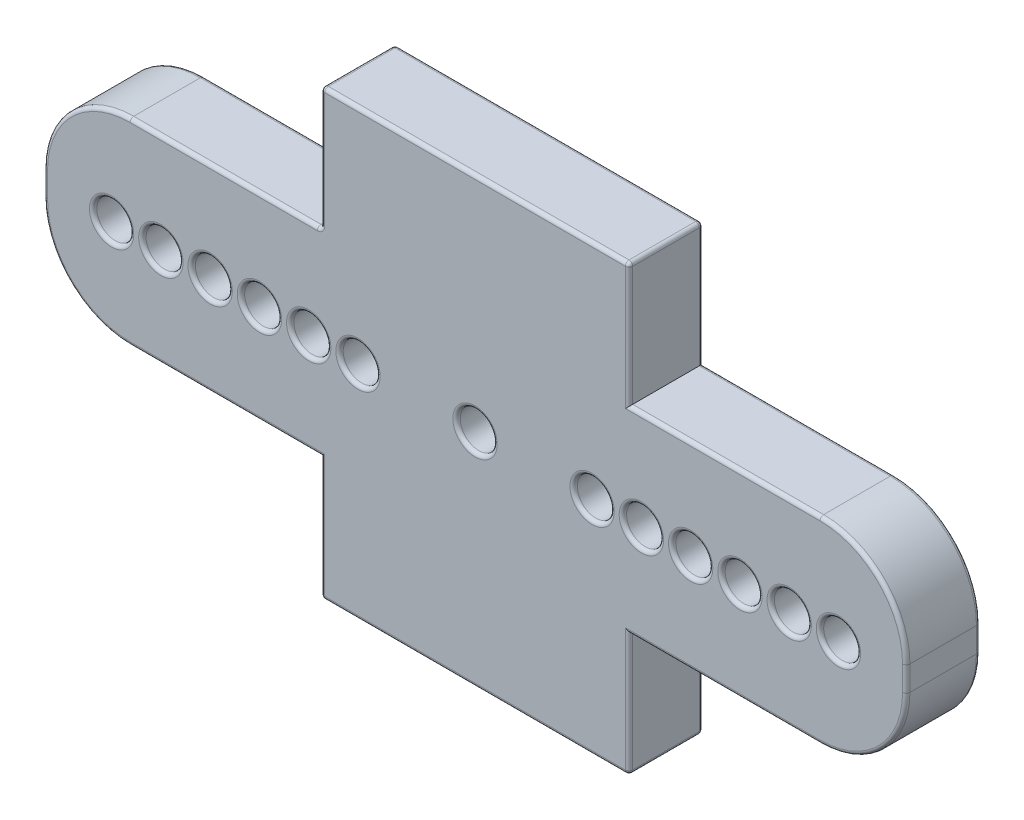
from build123d import *

# Parameters (mm, degrees)
SKETCH1_R           = 0.75
BOSS_EXTRUDE2_DEPTH = 1.5
CUT_EXTRUDE1_REACH  = 21.906
SKETCH2_R           = 0.75
FILLET2_R           = 0.15


with BuildPart() as part:
    # Sketch1 → Boss-Extrude2 (new, symmetric)
    with BuildSketch(Plane.XY):
        with BuildLine():
            Line((-17.5, 0.5), (-17.5, -0.5))
            ThreePointArc((-17.5, -0.5), (-16.474873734, -2.974873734), (-14, -4))
            Line((-14, -4), (-6.25, -4))
            Line((-6.25, -4), (-6.25, -9))
            Line((-6.25, -9), (6.25, -9))
            Line((6.25, -9), (6.25, -4))
            Line((6.25, -4), (14, -4))
            ThreePointArc((14, -4), (16.474873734, -2.974873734), (17.5, -0.5))
            Line((17.5, -0.5), (17.5, 0.5))
            ThreePointArc((17.5, 0.5), (16.474873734, 2.974873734), (14, 4))
            Line((14, 4), (6.25, 4))
            Line((6.25, 4), (6.25, 9))
            Line((6.25, 9), (-6.25, 9))
            Line((-6.25, 9), (-6.25, 4))
            Line((-6.25, 4), (-14, 4))
            ThreePointArc((-14, 4), (-16.474873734, 2.974873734), (-17.5, 0.5))
        make_face()
        Circle(SKETCH1_R, mode=Mode.SUBTRACT)
    extrude(amount=BOSS_EXTRUDE2_DEPTH, both=True)

    # Sketch2 → Cut-Extrude1 (cut, up to next)
    with BuildSketch(Plane.XY.offset(1.5), mode=Mode.PRIVATE) as cut_extrude1_sk1:
        with Locations((-14.75, 0)):
            Circle(SKETCH2_R)
    cut_extrude1_tool1 = extrude(cut_extrude1_sk1.sketch, amount=-CUT_EXTRUDE1_REACH, mode=Mode.PRIVATE) & part.part
    # Sketch2 → Cut-Extrude1 (cut, up to next)
    with BuildSketch(Plane.XY.offset(1.5), mode=Mode.PRIVATE) as cut_extrude1_sk2:
        with Locations((-12.75, 0)):
            Circle(SKETCH2_R)
    cut_extrude1_tool2 = extrude(cut_extrude1_sk2.sketch, amount=-CUT_EXTRUDE1_REACH, mode=Mode.PRIVATE) & part.part
    # Sketch2 → Cut-Extrude1 (cut, up to next)
    with BuildSketch(Plane.XY.offset(1.5), mode=Mode.PRIVATE) as cut_extrude1_sk3:
        with Locations((-10.75, 0)):
            Circle(SKETCH2_R)
    cut_extrude1_tool3 = extrude(cut_extrude1_sk3.sketch, amount=-CUT_EXTRUDE1_REACH, mode=Mode.PRIVATE) & part.part
    # Sketch2 → Cut-Extrude1 (cut, up to next)
    with BuildSketch(Plane.XY.offset(1.5), mode=Mode.PRIVATE) as cut_extrude1_sk4:
        with Locations((-8.75, 0)):
            Circle(SKETCH2_R)
    cut_extrude1_tool4 = extrude(cut_extrude1_sk4.sketch, amount=-CUT_EXTRUDE1_REACH, mode=Mode.PRIVATE) & part.part
    # Sketch2 → Cut-Extrude1 (cut, up to next)
    with BuildSketch(Plane.XY.offset(1.5), mode=Mode.PRIVATE) as cut_extrude1_sk5:
        with Locations((-6.75, 0)):
            Circle(SKETCH2_R)
    cut_extrude1_tool5 = extrude(cut_extrude1_sk5.sketch, amount=-CUT_EXTRUDE1_REACH, mode=Mode.PRIVATE) & part.part
    # Sketch2 → Cut-Extrude1 (cut, up to next)
    with BuildSketch(Plane.XY.offset(1.5), mode=Mode.PRIVATE) as cut_extrude1_sk6:
        with Locations((-4.75, 0)):
            Circle(SKETCH2_R)
    cut_extrude1_tool6 = extrude(cut_extrude1_sk6.sketch, amount=-CUT_EXTRUDE1_REACH, mode=Mode.PRIVATE) & part.part
    cut_extrude1_1 = cut_extrude1_tool1.solids().sort_by_distance((-14.75, 0, 1.5))[0]
    add(cut_extrude1_1, mode=Mode.SUBTRACT)
    cut_extrude1_2 = cut_extrude1_tool2.solids().sort_by_distance((-12.75, 0, 1.5))[0]
    add(cut_extrude1_2, mode=Mode.SUBTRACT)
    cut_extrude1_3 = cut_extrude1_tool3.solids().sort_by_distance((-10.75, 0, 1.5))[0]
    add(cut_extrude1_3, mode=Mode.SUBTRACT)
    cut_extrude1_4 = cut_extrude1_tool4.solids().sort_by_distance((-8.75, 0, 1.5))[0]
    add(cut_extrude1_4, mode=Mode.SUBTRACT)
    cut_extrude1_5 = cut_extrude1_tool5.solids().sort_by_distance((-6.75, 0, 1.5))[0]
    add(cut_extrude1_5, mode=Mode.SUBTRACT)
    cut_extrude1_6 = cut_extrude1_tool6.solids().sort_by_distance((-4.75, 0, 1.5))[0]
    add(cut_extrude1_6, mode=Mode.SUBTRACT)
    cut_extrude1 = cut_extrude1_1 + cut_extrude1_2 + cut_extrude1_3 + cut_extrude1_4 + cut_extrude1_5 + cut_extrude1_6  # Cut-Extrude1 as one shape, for the pattern or mirror that repeats it

    # Mirror1: Cut-Extrude1 across plane
    add(cut_extrude1.mirror(Plane(origin=(0, 0, 0), x_dir=(0, 0, 1), z_dir=(1, 0, 0))), mode=Mode.SUBTRACT)

    # Fillet2
    fillet2_edges = [part.edges().sort_by_distance(p)[0] for p in [
        (-16.474873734, 2.974873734, 1.5),
        (-17.5, 0, 1.5),
        (0, 9, -1.5),
        (6.25, 6.5, -1.5),
        (10.125, 4, -1.5),
        (16.474873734, 2.974873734, -1.5),
        (17.5, 0, -1.5),
        (-16.474873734, -2.974873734, 1.5),
        (16.474873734, -2.974873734, -1.5),
        (10.125, -4, -1.5),
        (6.25, -6.5, -1.5),
        (0, -9, -1.5),
        (-6.25, -6.5, -1.5),
        (-10.125, -4, -1.5),
        (-16.474873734, -2.974873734, -1.5),
        (-17.5, 0, -1.5),
        (-10.125, -4, 1.5),
        (-16.474873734, 2.974873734, -1.5),
        (-10.125, 4, -1.5),
        (-6.25, 6.5, -1.5),
        (-6.25, -6.5, 1.5),
        (0, -9, 1.5),
        (-6.25, 9, 0),
        (6.25, 9, 0),
        (6.25, -9, 0),
        (-6.25, -9, 0),
        (-6.25, 4, 0),
        (6.25, -6.5, 1.5),
        (10.125, -4, 1.5),
        (16.474873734, -2.974873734, 1.5),
        (17.5, 0, 1.5),
        (-0.75, 0, -1.5),
        (-0.75, 0, 1.5),
        (-6.25, 6.5, 1.5),
        (16.474873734, 2.974873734, 1.5),
        (10.125, 4, 1.5),
        (6.25, 6.5, 1.5),
        (0, 9, 1.5),
        (-15.5, 0, 1.5),
        (-15.5, 0, -1.5),
        (-13.5, 0, 1.5),
        (-13.5, 0, -1.5),
        (-11.5, 0, 1.5),
        (-11.5, 0, -1.5),
        (-9.5, 0, 1.5),
        (-9.5, 0, -1.5),
        (-7.5, 0, 1.5),
        (-7.5, 0, -1.5),
        (-5.5, 0, 1.5),
        (-5.5, 0, -1.5),
        (-10.125, 4, 1.5),
        (15.5, 0, 1.5),
        (15.5, 0, -1.5),
        (13.5, 0, 1.5),
        (13.5, 0, -1.5),
        (11.5, 0, 1.5),
        (11.5, 0, -1.5),
        (9.5, 0, 1.5),
        (9.5, 0, -1.5),
        (7.5, 0, 1.5),
        (7.5, 0, -1.5),
        (5.5, 0, 1.5),
        (5.5, 0, -1.5),
    ]]
    fillet(fillet2_edges, radius=FILLET2_R)


solid = part.part
